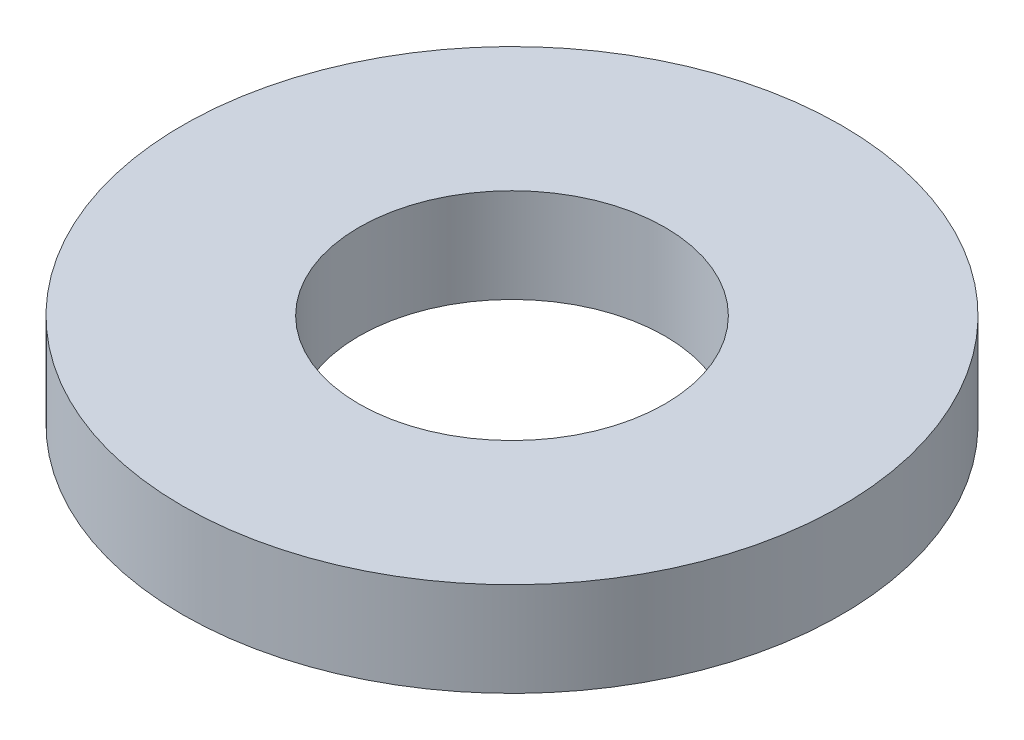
from build123d import *

# Parameters (mm, degrees)
SKETCH1_R      = 11.1125
SKETCH1_R_2    = 5.159375
EXTRUDE1_DEPTH = 3.175


with BuildPart() as part:
    # Sketch1 → Extrude1 (new body)
    with BuildSketch(Plane(origin=(0, 0, 0), x_dir=(1, 0, 0), z_dir=(0, 1, 0))):
        with Locations(Location((0, 0, 0), (0, 0, 270))):
            Circle(SKETCH1_R)
        with Locations(Location((0, 0, 0), (0, 0, 270))):
            Circle(SKETCH1_R_2, mode=Mode.SUBTRACT)
    extrude(amount=EXTRUDE1_DEPTH)


solid = part.part
